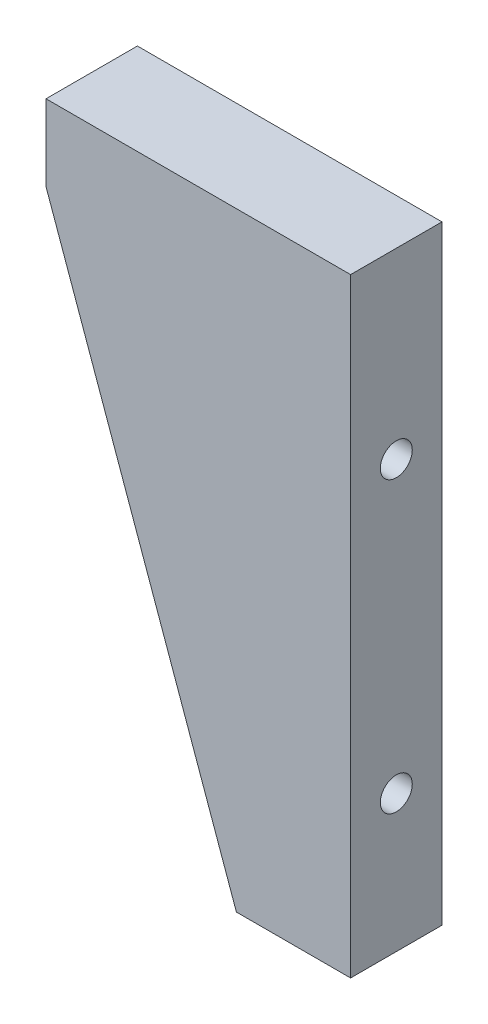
ISO-10303-21;
HEADER;
FILE_DESCRIPTION(('STEP AP214'),'2;1');
FILE_NAME('part.step','',(''),(''),'','','');
FILE_SCHEMA(('AUTOMOTIVE_DESIGN { 1 0 10303 214 1 1 1 1 }'));
ENDSEC;
DATA;
#1=APPLICATION_CONTEXT('core data for automotive mechanical design processes');
#2=APPLICATION_PROTOCOL_DEFINITION('international standard','automotive_design',2000,#1);
#3=PRODUCT_CONTEXT('',#1,'mechanical');
#4=PRODUCT('Part','Part','',(#3));
#5=PRODUCT_RELATED_PRODUCT_CATEGORY('part','',(#4));
#6=PRODUCT_DEFINITION_FORMATION('','',#4);
#7=PRODUCT_DEFINITION_CONTEXT('part definition',#1,'design');
#8=PRODUCT_DEFINITION('design','',#6,#7);
#9=PRODUCT_DEFINITION_SHAPE('','',#8);
#10=(LENGTH_UNIT() NAMED_UNIT(*) SI_UNIT(.MILLI.,.METRE.));
#11=(NAMED_UNIT(*) PLANE_ANGLE_UNIT() SI_UNIT($,.RADIAN.));
#12=(NAMED_UNIT(*) SI_UNIT($,.STERADIAN.) SOLID_ANGLE_UNIT());
#13=UNCERTAINTY_MEASURE_WITH_UNIT(LENGTH_MEASURE(1.E-05),#10,'distance_accuracy_value','');
#14=(GEOMETRIC_REPRESENTATION_CONTEXT(3) GLOBAL_UNCERTAINTY_ASSIGNED_CONTEXT((#13)) GLOBAL_UNIT_ASSIGNED_CONTEXT((#10,
#11,#12)) REPRESENTATION_CONTEXT('',''));
#15=CARTESIAN_POINT('',(0.,0.,0.));
#16=DIRECTION('',(0.,0.,1.));
#17=DIRECTION('',(1.,0.,0.));
#18=AXIS2_PLACEMENT_3D('',#15,#16,#17);
#19=CARTESIAN_POINT('',(0.,-17.,12.));
#20=DIRECTION('',(-1.,0.,0.));
#21=DIRECTION('',(0.,-1.,0.));
#22=AXIS2_PLACEMENT_3D('',#19,#20,#21);
#23=PLANE('',#22);
#24=CARTESIAN_POINT('',(0.,-41.,6.));
#25=DIRECTION('',(1.,0.,0.));
#26=DIRECTION('',(0.,0.,-1.));
#27=AXIS2_PLACEMENT_3D('',#24,#25,#26);
#28=CIRCLE('',#27,2.1);
#29=CARTESIAN_POINT('',(0.,-41.,3.9));
#30=VERTEX_POINT('',#29);
#31=EDGE_CURVE('E132',#30,#30,#28,.T.);
#32=ORIENTED_EDGE('',*,*,#31,.F.);
#33=EDGE_LOOP('',(#32));
#34=FACE_BOUND('',#33,.T.);
#35=CARTESIAN_POINT('',(0.,-79.,6.));
#36=DIRECTION('',(1.,0.,0.));
#37=DIRECTION('',(0.,0.,-1.));
#38=AXIS2_PLACEMENT_3D('',#35,#36,#37);
#39=CIRCLE('',#38,2.1);
#40=CARTESIAN_POINT('',(0.,-79.,3.9));
#41=VERTEX_POINT('',#40);
#42=EDGE_CURVE('E135',#41,#41,#39,.T.);
#43=ORIENTED_EDGE('',*,*,#42,.F.);
#44=EDGE_LOOP('',(#43));
#45=FACE_BOUND('',#44,.T.);
#46=DIRECTION('',(0.,1.,0.));
#47=VECTOR('',#46,1.);
#48=CARTESIAN_POINT('',(0.,-17.,0.));
#49=LINE('',#48,#47);
#50=CARTESIAN_POINT('',(0.,-97.,0.));
#51=VERTEX_POINT('',#50);
#52=CARTESIAN_POINT('',(0.,-17.,0.));
#53=VERTEX_POINT('',#52);
#54=EDGE_CURVE('E93',#51,#53,#49,.T.);
#55=ORIENTED_EDGE('',*,*,#54,.T.);
#56=DIRECTION('',(0.,0.,-1.));
#57=VECTOR('',#56,1.);
#58=CARTESIAN_POINT('',(0.,-17.,12.));
#59=LINE('',#58,#57);
#60=CARTESIAN_POINT('',(0.,-17.,12.));
#61=VERTEX_POINT('',#60);
#62=EDGE_CURVE('E11',#61,#53,#59,.T.);
#63=ORIENTED_EDGE('',*,*,#62,.F.);
#64=DIRECTION('',(0.,1.,0.));
#65=VECTOR('',#64,1.);
#66=CARTESIAN_POINT('',(0.,-17.,12.));
#67=LINE('',#66,#65);
#68=CARTESIAN_POINT('',(0.,-97.,12.));
#69=VERTEX_POINT('',#68);
#70=EDGE_CURVE('E102',#69,#61,#67,.T.);
#71=ORIENTED_EDGE('',*,*,#70,.F.);
#72=DIRECTION('',(0.,0.,-1.));
#73=VECTOR('',#72,1.);
#74=CARTESIAN_POINT('',(0.,-97.,12.));
#75=LINE('',#74,#73);
#76=EDGE_CURVE('E89',#69,#51,#75,.T.);
#77=ORIENTED_EDGE('',*,*,#76,.T.);
#78=EDGE_LOOP('',(#55,#63,#71,#77));
#79=FACE_BOUND('',#78,.T.);
#80=ADVANCED_FACE('F16',(#34,#45,#79),#23,.F.);
#81=CARTESIAN_POINT('',(0.,-17.,12.));
#82=DIRECTION('',(0.,-1.,0.));
#83=DIRECTION('',(1.,0.,0.));
#84=AXIS2_PLACEMENT_3D('',#81,#82,#83);
#85=PLANE('',#84);
#86=DIRECTION('',(-1.,0.,0.));
#87=VECTOR('',#86,1.);
#88=CARTESIAN_POINT('',(0.,-17.,0.));
#89=LINE('',#88,#87);
#90=CARTESIAN_POINT('',(-40.,-17.,0.));
#91=VERTEX_POINT('',#90);
#92=EDGE_CURVE('E96',#53,#91,#89,.T.);
#93=ORIENTED_EDGE('',*,*,#92,.T.);
#94=DIRECTION('',(0.,0.,-1.));
#95=VECTOR('',#94,1.);
#96=CARTESIAN_POINT('',(-40.,-17.,12.));
#97=LINE('',#96,#95);
#98=CARTESIAN_POINT('',(-40.,-17.,12.));
#99=VERTEX_POINT('',#98);
#100=EDGE_CURVE('E24',#99,#91,#97,.T.);
#101=ORIENTED_EDGE('',*,*,#100,.F.);
#102=DIRECTION('',(-1.,0.,0.));
#103=VECTOR('',#102,1.);
#104=CARTESIAN_POINT('',(0.,-17.,12.));
#105=LINE('',#104,#103);
#106=EDGE_CURVE('E67',#61,#99,#105,.T.);
#107=ORIENTED_EDGE('',*,*,#106,.F.);
#108=ORIENTED_EDGE('',*,*,#62,.T.);
#109=EDGE_LOOP('',(#93,#101,#107,#108));
#110=FACE_BOUND('',#109,.T.);
#111=ADVANCED_FACE('F123',(#110),#85,.F.);
#112=CARTESIAN_POINT('',(-40.,-17.,12.));
#113=DIRECTION('',(1.,0.,0.));
#114=DIRECTION('',(0.,0.,-1.));
#115=AXIS2_PLACEMENT_3D('',#112,#113,#114);
#116=PLANE('',#115);
#117=DIRECTION('',(0.,-1.,0.));
#118=VECTOR('',#117,1.);
#119=CARTESIAN_POINT('',(-40.,-17.,0.));
#120=LINE('',#119,#118);
#121=CARTESIAN_POINT('',(-40.,-27.,0.));
#122=VERTEX_POINT('',#121);
#123=EDGE_CURVE('E84',#91,#122,#120,.T.);
#124=ORIENTED_EDGE('',*,*,#123,.T.);
#125=DIRECTION('',(0.,0.,-1.));
#126=VECTOR('',#125,1.);
#127=CARTESIAN_POINT('',(-40.,-27.,12.));
#128=LINE('',#127,#126);
#129=CARTESIAN_POINT('',(-40.,-27.,12.));
#130=VERTEX_POINT('',#129);
#131=EDGE_CURVE('E81',#130,#122,#128,.T.);
#132=ORIENTED_EDGE('',*,*,#131,.F.);
#133=DIRECTION('',(0.,-1.,0.));
#134=VECTOR('',#133,1.);
#135=CARTESIAN_POINT('',(-40.,-17.,12.));
#136=LINE('',#135,#134);
#137=EDGE_CURVE('E73',#99,#130,#136,.T.);
#138=ORIENTED_EDGE('',*,*,#137,.F.);
#139=ORIENTED_EDGE('',*,*,#100,.T.);
#140=EDGE_LOOP('',(#124,#132,#138,#139));
#141=FACE_BOUND('',#140,.T.);
#142=ADVANCED_FACE('F82',(#141),#116,.F.);
#143=CARTESIAN_POINT('',(-15.,-97.,12.));
#144=DIRECTION('',(0.941741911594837,0.336336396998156,0.));
#145=DIRECTION('',(-0.336336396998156,0.941741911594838,0.));
#146=AXIS2_PLACEMENT_3D('',#143,#144,#145);
#147=PLANE('',#146);
#148=DIRECTION('',(0.336336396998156,-0.941741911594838,0.));
#149=VECTOR('',#148,1.);
#150=CARTESIAN_POINT('',(-15.,-97.,0.));
#151=LINE('',#150,#149);
#152=CARTESIAN_POINT('',(-15.,-97.,0.));
#153=VERTEX_POINT('',#152);
#154=EDGE_CURVE('E53',#122,#153,#151,.T.);
#155=ORIENTED_EDGE('',*,*,#154,.T.);
#156=DIRECTION('',(0.,0.,-1.));
#157=VECTOR('',#156,1.);
#158=CARTESIAN_POINT('',(-15.,-97.,12.));
#159=LINE('',#158,#157);
#160=CARTESIAN_POINT('',(-15.,-97.,12.));
#161=VERTEX_POINT('',#160);
#162=EDGE_CURVE('E85',#161,#153,#159,.T.);
#163=ORIENTED_EDGE('',*,*,#162,.F.);
#164=DIRECTION('',(0.336336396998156,-0.941741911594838,0.));
#165=VECTOR('',#164,1.);
#166=CARTESIAN_POINT('',(-15.,-97.,12.));
#167=LINE('',#166,#165);
#168=EDGE_CURVE('E77',#130,#161,#167,.T.);
#169=ORIENTED_EDGE('',*,*,#168,.F.);
#170=ORIENTED_EDGE('',*,*,#131,.T.);
#171=EDGE_LOOP('',(#155,#163,#169,#170));
#172=FACE_BOUND('',#171,.T.);
#173=ADVANCED_FACE('F87',(#172),#147,.F.);
#174=CARTESIAN_POINT('',(0.,-97.,12.));
#175=DIRECTION('',(0.,1.,0.));
#176=DIRECTION('',(0.,0.,1.));
#177=AXIS2_PLACEMENT_3D('',#174,#175,#176);
#178=PLANE('',#177);
#179=DIRECTION('',(1.,0.,0.));
#180=VECTOR('',#179,1.);
#181=CARTESIAN_POINT('',(0.,-97.,0.));
#182=LINE('',#181,#180);
#183=EDGE_CURVE('E59',#153,#51,#182,.T.);
#184=ORIENTED_EDGE('',*,*,#183,.T.);
#185=ORIENTED_EDGE('',*,*,#76,.F.);
#186=DIRECTION('',(1.,0.,0.));
#187=VECTOR('',#186,1.);
#188=CARTESIAN_POINT('',(0.,-97.,12.));
#189=LINE('',#188,#187);
#190=EDGE_CURVE('E32',#161,#69,#189,.T.);
#191=ORIENTED_EDGE('',*,*,#190,.F.);
#192=ORIENTED_EDGE('',*,*,#162,.T.);
#193=EDGE_LOOP('',(#184,#185,#191,#192));
#194=FACE_BOUND('',#193,.T.);
#195=ADVANCED_FACE('F110',(#194),#178,.F.);
#196=CARTESIAN_POINT('',(0.,0.,12.));
#197=DIRECTION('',(0.,0.,-1.));
#198=DIRECTION('',(-1.,0.,0.));
#199=AXIS2_PLACEMENT_3D('',#196,#197,#198);
#200=PLANE('',#199);
#201=ORIENTED_EDGE('',*,*,#70,.T.);
#202=ORIENTED_EDGE('',*,*,#106,.T.);
#203=ORIENTED_EDGE('',*,*,#137,.T.);
#204=ORIENTED_EDGE('',*,*,#168,.T.);
#205=ORIENTED_EDGE('',*,*,#190,.T.);
#206=EDGE_LOOP('',(#201,#202,#203,#204,#205));
#207=FACE_BOUND('',#206,.T.);
#208=ADVANCED_FACE('F75',(#207),#200,.F.);
#209=CARTESIAN_POINT('',(0.,0.,0.));
#210=DIRECTION('',(0.,0.,-1.));
#211=DIRECTION('',(-1.,0.,0.));
#212=AXIS2_PLACEMENT_3D('',#209,#210,#211);
#213=PLANE('',#212);
#214=ORIENTED_EDGE('',*,*,#54,.F.);
#215=ORIENTED_EDGE('',*,*,#183,.F.);
#216=ORIENTED_EDGE('',*,*,#154,.F.);
#217=ORIENTED_EDGE('',*,*,#123,.F.);
#218=ORIENTED_EDGE('',*,*,#92,.F.);
#219=EDGE_LOOP('',(#214,#215,#216,#217,#218));
#220=FACE_BOUND('',#219,.T.);
#221=ADVANCED_FACE('F106',(#220),#213,.T.);
#222=CARTESIAN_POINT('',(-16.,-79.,6.));
#223=DIRECTION('',(1.,0.,0.));
#224=DIRECTION('',(0.,0.,-1.));
#225=AXIS2_PLACEMENT_3D('',#222,#223,#224);
#226=CONICAL_SURFACE('',#225,2.1,1.02974425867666);
#227=CARTESIAN_POINT('',(-17.2618072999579,-79.,6.));
#228=VERTEX_POINT('',#227);
#229=VERTEX_LOOP('',#228);
#230=FACE_BOUND('',#229,.T.);
#231=CARTESIAN_POINT('',(-16.,-79.,6.));
#232=DIRECTION('',(1.,0.,0.));
#233=DIRECTION('',(0.,0.,-1.));
#234=AXIS2_PLACEMENT_3D('',#231,#232,#233);
#235=CIRCLE('',#234,2.1);
#236=CARTESIAN_POINT('',(-16.,-79.,3.9));
#237=VERTEX_POINT('',#236);
#238=EDGE_CURVE('E97',#237,#237,#235,.T.);
#239=ORIENTED_EDGE('',*,*,#238,.T.);
#240=EDGE_LOOP('',(#239));
#241=FACE_BOUND('',#240,.T.);
#242=ADVANCED_FACE('F162',(#230,#241),#226,.F.);
#243=CARTESIAN_POINT('',(0.,-79.,6.));
#244=DIRECTION('',(1.,0.,0.));
#245=DIRECTION('',(0.,0.,-1.));
#246=AXIS2_PLACEMENT_3D('',#243,#244,#245);
#247=CYLINDRICAL_SURFACE('',#246,2.1);
#248=ORIENTED_EDGE('',*,*,#238,.F.);
#249=EDGE_LOOP('',(#248));
#250=FACE_BOUND('',#249,.T.);
#251=ORIENTED_EDGE('',*,*,#42,.T.);
#252=EDGE_LOOP('',(#251));
#253=FACE_BOUND('',#252,.T.);
#254=ADVANCED_FACE('F155',(#250,#253),#247,.F.);
#255=CARTESIAN_POINT('',(-16.,-41.,6.));
#256=DIRECTION('',(1.,0.,0.));
#257=DIRECTION('',(0.,0.,-1.));
#258=AXIS2_PLACEMENT_3D('',#255,#256,#257);
#259=CONICAL_SURFACE('',#258,2.1,1.02974425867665);
#260=CARTESIAN_POINT('',(-17.2618072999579,-41.,6.));
#261=VERTEX_POINT('',#260);
#262=VERTEX_LOOP('',#261);
#263=FACE_BOUND('',#262,.T.);
#264=CARTESIAN_POINT('',(-16.,-41.,6.));
#265=DIRECTION('',(1.,0.,0.));
#266=DIRECTION('',(0.,0.,-1.));
#267=AXIS2_PLACEMENT_3D('',#264,#265,#266);
#268=CIRCLE('',#267,2.1);
#269=CARTESIAN_POINT('',(-16.,-41.,3.9));
#270=VERTEX_POINT('',#269);
#271=EDGE_CURVE('E137',#270,#270,#268,.T.);
#272=ORIENTED_EDGE('',*,*,#271,.T.);
#273=EDGE_LOOP('',(#272));
#274=FACE_BOUND('',#273,.T.);
#275=ADVANCED_FACE('F148',(#263,#274),#259,.F.);
#276=CARTESIAN_POINT('',(0.,-41.,6.));
#277=DIRECTION('',(1.,0.,0.));
#278=DIRECTION('',(0.,0.,-1.));
#279=AXIS2_PLACEMENT_3D('',#276,#277,#278);
#280=CYLINDRICAL_SURFACE('',#279,2.1);
#281=ORIENTED_EDGE('',*,*,#271,.F.);
#282=EDGE_LOOP('',(#281));
#283=FACE_BOUND('',#282,.T.);
#284=ORIENTED_EDGE('',*,*,#31,.T.);
#285=EDGE_LOOP('',(#284));
#286=FACE_BOUND('',#285,.T.);
#287=ADVANCED_FACE('F146',(#283,#286),#280,.F.);
#288=CLOSED_SHELL('',(#80,#111,#142,#173,#195,#208,#221,#242,#254,#275,#287));
#289=MANIFOLD_SOLID_BREP('B1',#288);
#290=ADVANCED_BREP_SHAPE_REPRESENTATION('',(#18,#289),#14);
#291=SHAPE_DEFINITION_REPRESENTATION(#9,#290);
ENDSEC;
END-ISO-10303-21;
